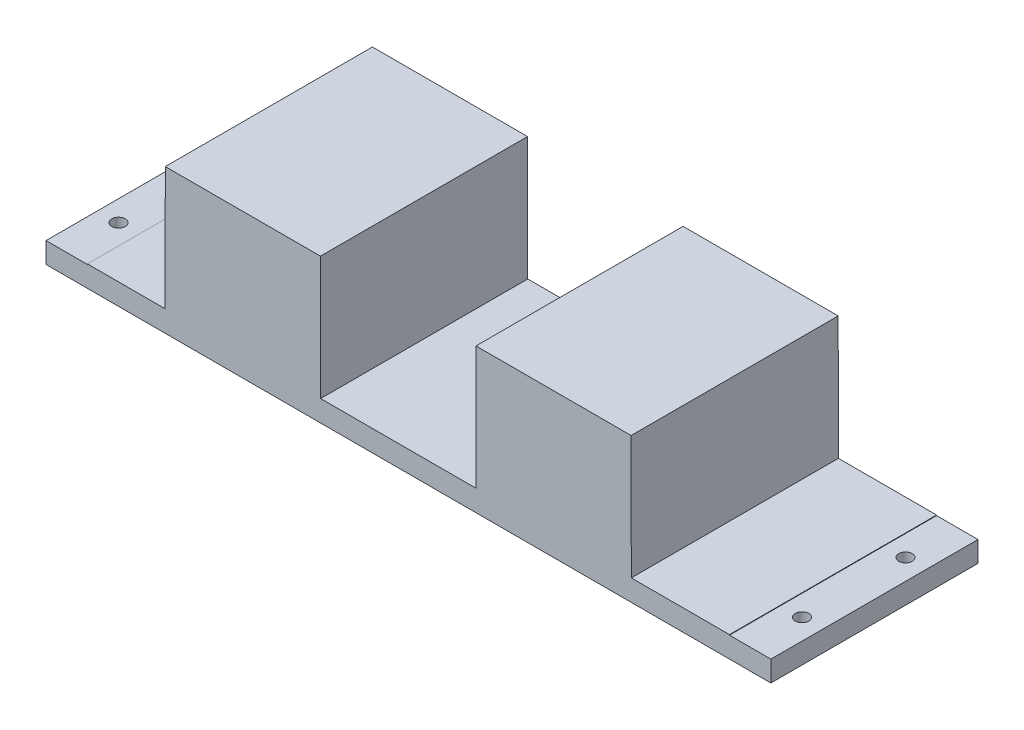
ISO-10303-21;
HEADER;
FILE_DESCRIPTION(('STEP AP214'),'2;1');
FILE_NAME('part.step','',(''),(''),'','','');
FILE_SCHEMA(('AUTOMOTIVE_DESIGN { 1 0 10303 214 1 1 1 1 }'));
ENDSEC;
DATA;
#1=APPLICATION_CONTEXT('core data for automotive mechanical design processes');
#2=APPLICATION_PROTOCOL_DEFINITION('international standard','automotive_design',2000,#1);
#3=PRODUCT_CONTEXT('',#1,'mechanical');
#4=PRODUCT('Part','Part','',(#3));
#5=PRODUCT_RELATED_PRODUCT_CATEGORY('part','',(#4));
#6=PRODUCT_DEFINITION_FORMATION('','',#4);
#7=PRODUCT_DEFINITION_CONTEXT('part definition',#1,'design');
#8=PRODUCT_DEFINITION('design','',#6,#7);
#9=PRODUCT_DEFINITION_SHAPE('','',#8);
#10=(LENGTH_UNIT() NAMED_UNIT(*) SI_UNIT(.MILLI.,.METRE.));
#11=(NAMED_UNIT(*) PLANE_ANGLE_UNIT() SI_UNIT($,.RADIAN.));
#12=(NAMED_UNIT(*) SI_UNIT($,.STERADIAN.) SOLID_ANGLE_UNIT());
#13=UNCERTAINTY_MEASURE_WITH_UNIT(LENGTH_MEASURE(1.E-05),#10,'distance_accuracy_value','');
#14=(GEOMETRIC_REPRESENTATION_CONTEXT(3) GLOBAL_UNCERTAINTY_ASSIGNED_CONTEXT((#13)) GLOBAL_UNIT_ASSIGNED_CONTEXT((#10,
#11,#12)) REPRESENTATION_CONTEXT('',''));
#15=CARTESIAN_POINT('',(0.,0.,0.));
#16=DIRECTION('',(0.,0.,1.));
#17=DIRECTION('',(1.,0.,0.));
#18=AXIS2_PLACEMENT_3D('',#15,#16,#17);
#19=CARTESIAN_POINT('',(0.,0.248118,100.));
#20=DIRECTION('',(1.,0.,0.));
#21=DIRECTION('',(0.,0.,-1.));
#22=AXIS2_PLACEMENT_3D('',#19,#20,#21);
#23=PLANE('',#22);
#24=DIRECTION('',(0.,-1.,0.));
#25=VECTOR('',#24,1.);
#26=CARTESIAN_POINT('',(0.,0.248118,0.));
#27=LINE('',#26,#25);
#28=CARTESIAN_POINT('',(0.,0.248118,0.));
#29=VERTEX_POINT('',#28);
#30=CARTESIAN_POINT('',(0.,0.,0.));
#31=VERTEX_POINT('',#30);
#32=EDGE_CURVE('E179',#29,#31,#27,.T.);
#33=ORIENTED_EDGE('',*,*,#32,.T.);
#34=DIRECTION('',(0.,0.,-1.));
#35=VECTOR('',#34,1.);
#36=CARTESIAN_POINT('',(0.,0.,100.));
#37=LINE('',#36,#35);
#38=CARTESIAN_POINT('',(0.,0.,100.));
#39=VERTEX_POINT('',#38);
#40=EDGE_CURVE('E11',#39,#31,#37,.T.);
#41=ORIENTED_EDGE('',*,*,#40,.F.);
#42=DIRECTION('',(0.,-1.,0.));
#43=VECTOR('',#42,1.);
#44=CARTESIAN_POINT('',(0.,0.248118,100.));
#45=LINE('',#44,#43);
#46=CARTESIAN_POINT('',(0.,0.248118,100.));
#47=VERTEX_POINT('',#46);
#48=EDGE_CURVE('E215',#47,#39,#45,.T.);
#49=ORIENTED_EDGE('',*,*,#48,.F.);
#50=DIRECTION('',(0.,0.,-1.));
#51=VECTOR('',#50,1.);
#52=CARTESIAN_POINT('',(0.,0.248118,100.));
#53=LINE('',#52,#51);
#54=EDGE_CURVE('E175',#47,#29,#53,.T.);
#55=ORIENTED_EDGE('',*,*,#54,.T.);
#56=EDGE_LOOP('',(#33,#41,#49,#55));
#57=FACE_BOUND('',#56,.T.);
#58=ADVANCED_FACE('F33',(#57),#23,.F.);
#59=CARTESIAN_POINT('',(0.,0.,100.));
#60=DIRECTION('',(0.,-1.,0.));
#61=DIRECTION('',(1.,0.,0.));
#62=AXIS2_PLACEMENT_3D('',#59,#60,#61);
#63=PLANE('',#62);
#64=CARTESIAN_POINT('',(-10.,0.,25.));
#65=DIRECTION('',(0.,-1.,0.));
#66=DIRECTION('',(1.,0.,0.));
#67=AXIS2_PLACEMENT_3D('',#64,#65,#66);
#68=CIRCLE('',#67,3.25);
#69=CARTESIAN_POINT('',(-6.75,0.,25.));
#70=VERTEX_POINT('',#69);
#71=EDGE_CURVE('E183',#70,#70,#68,.T.);
#72=ORIENTED_EDGE('',*,*,#71,.T.);
#73=EDGE_LOOP('',(#72));
#74=FACE_BOUND('',#73,.T.);
#75=CARTESIAN_POINT('',(-10.,0.,75.));
#76=DIRECTION('',(0.,-1.,0.));
#77=DIRECTION('',(1.,0.,0.));
#78=AXIS2_PLACEMENT_3D('',#75,#76,#77);
#79=CIRCLE('',#78,3.25);
#80=CARTESIAN_POINT('',(-6.75,0.,75.));
#81=VERTEX_POINT('',#80);
#82=EDGE_CURVE('E260',#81,#81,#79,.T.);
#83=ORIENTED_EDGE('',*,*,#82,.T.);
#84=EDGE_LOOP('',(#83));
#85=FACE_BOUND('',#84,.T.);
#86=DIRECTION('',(-1.,0.,0.));
#87=VECTOR('',#86,1.);
#88=CARTESIAN_POINT('',(0.,0.,0.));
#89=LINE('',#88,#87);
#90=CARTESIAN_POINT('',(-20.,0.,0.));
#91=VERTEX_POINT('',#90);
#92=EDGE_CURVE('E182',#31,#91,#89,.T.);
#93=ORIENTED_EDGE('',*,*,#92,.T.);
#94=DIRECTION('',(0.,0.,-1.));
#95=VECTOR('',#94,1.);
#96=CARTESIAN_POINT('',(-20.,0.,100.));
#97=LINE('',#96,#95);
#98=CARTESIAN_POINT('',(-20.,0.,100.));
#99=VERTEX_POINT('',#98);
#100=EDGE_CURVE('E42',#99,#91,#97,.T.);
#101=ORIENTED_EDGE('',*,*,#100,.F.);
#102=DIRECTION('',(-1.,0.,0.));
#103=VECTOR('',#102,1.);
#104=CARTESIAN_POINT('',(0.,0.,100.));
#105=LINE('',#104,#103);
#106=EDGE_CURVE('E116',#39,#99,#105,.T.);
#107=ORIENTED_EDGE('',*,*,#106,.F.);
#108=ORIENTED_EDGE('',*,*,#40,.T.);
#109=EDGE_LOOP('',(#93,#101,#107,#108));
#110=FACE_BOUND('',#109,.T.);
#111=ADVANCED_FACE('F311',(#74,#85,#110),#63,.F.);
#112=CARTESIAN_POINT('',(-20.,0.,100.));
#113=DIRECTION('',(1.,0.,0.));
#114=DIRECTION('',(0.,0.,-1.));
#115=AXIS2_PLACEMENT_3D('',#112,#113,#114);
#116=PLANE('',#115);
#117=DIRECTION('',(0.,-1.,0.));
#118=VECTOR('',#117,1.);
#119=CARTESIAN_POINT('',(-20.,0.,0.));
#120=LINE('',#119,#118);
#121=CARTESIAN_POINT('',(-20.,-10.,0.));
#122=VERTEX_POINT('',#121);
#123=EDGE_CURVE('E185',#91,#122,#120,.T.);
#124=ORIENTED_EDGE('',*,*,#123,.T.);
#125=DIRECTION('',(0.,0.,-1.));
#126=VECTOR('',#125,1.);
#127=CARTESIAN_POINT('',(-20.,-10.,100.));
#128=LINE('',#127,#126);
#129=CARTESIAN_POINT('',(-20.,-10.,100.));
#130=VERTEX_POINT('',#129);
#131=EDGE_CURVE('E246',#130,#122,#128,.T.);
#132=ORIENTED_EDGE('',*,*,#131,.F.);
#133=DIRECTION('',(0.,-1.,0.));
#134=VECTOR('',#133,1.);
#135=CARTESIAN_POINT('',(-20.,0.,100.));
#136=LINE('',#135,#134);
#137=EDGE_CURVE('E275',#99,#130,#136,.T.);
#138=ORIENTED_EDGE('',*,*,#137,.F.);
#139=ORIENTED_EDGE('',*,*,#100,.T.);
#140=EDGE_LOOP('',(#124,#132,#138,#139));
#141=FACE_BOUND('',#140,.T.);
#142=ADVANCED_FACE('F314',(#141),#116,.F.);
#143=CARTESIAN_POINT('',(-20.,-10.,100.));
#144=DIRECTION('',(0.,1.,0.));
#145=DIRECTION('',(0.,0.,1.));
#146=AXIS2_PLACEMENT_3D('',#143,#144,#145);
#147=PLANE('',#146);
#148=CARTESIAN_POINT('',(-10.,-10.,25.));
#149=DIRECTION('',(0.,1.,0.));
#150=DIRECTION('',(0.,0.,1.));
#151=AXIS2_PLACEMENT_3D('',#148,#149,#150);
#152=CIRCLE('',#151,3.25);
#153=CARTESIAN_POINT('',(-10.,-10.,28.25));
#154=VERTEX_POINT('',#153);
#155=EDGE_CURVE('E36',#154,#154,#152,.T.);
#156=ORIENTED_EDGE('',*,*,#155,.T.);
#157=EDGE_LOOP('',(#156));
#158=FACE_BOUND('',#157,.T.);
#159=CARTESIAN_POINT('',(320.,-10.,25.));
#160=DIRECTION('',(0.,1.,0.));
#161=DIRECTION('',(0.,0.,1.));
#162=AXIS2_PLACEMENT_3D('',#159,#160,#161);
#163=CIRCLE('',#162,3.25000000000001);
#164=CARTESIAN_POINT('',(320.,-10.,28.25));
#165=VERTEX_POINT('',#164);
#166=EDGE_CURVE('E257',#165,#165,#163,.T.);
#167=ORIENTED_EDGE('',*,*,#166,.T.);
#168=EDGE_LOOP('',(#167));
#169=FACE_BOUND('',#168,.T.);
#170=CARTESIAN_POINT('',(320.,-10.,75.));
#171=DIRECTION('',(0.,1.,0.));
#172=DIRECTION('',(0.,0.,1.));
#173=AXIS2_PLACEMENT_3D('',#170,#171,#172);
#174=CIRCLE('',#173,3.25000000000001);
#175=CARTESIAN_POINT('',(320.,-10.,78.25));
#176=VERTEX_POINT('',#175);
#177=EDGE_CURVE('E254',#176,#176,#174,.T.);
#178=ORIENTED_EDGE('',*,*,#177,.T.);
#179=EDGE_LOOP('',(#178));
#180=FACE_BOUND('',#179,.T.);
#181=CARTESIAN_POINT('',(-10.,-10.,75.));
#182=DIRECTION('',(0.,1.,0.));
#183=DIRECTION('',(0.,0.,1.));
#184=AXIS2_PLACEMENT_3D('',#181,#182,#183);
#185=CIRCLE('',#184,3.25);
#186=CARTESIAN_POINT('',(-10.,-10.,78.25));
#187=VERTEX_POINT('',#186);
#188=EDGE_CURVE('E258',#187,#187,#185,.T.);
#189=ORIENTED_EDGE('',*,*,#188,.T.);
#190=EDGE_LOOP('',(#189));
#191=FACE_BOUND('',#190,.T.);
#192=DIRECTION('',(1.,0.,0.));
#193=VECTOR('',#192,1.);
#194=CARTESIAN_POINT('',(-20.,-10.,0.));
#195=LINE('',#194,#193);
#196=CARTESIAN_POINT('',(330.,-10.,0.));
#197=VERTEX_POINT('',#196);
#198=EDGE_CURVE('E187',#122,#197,#195,.T.);
#199=ORIENTED_EDGE('',*,*,#198,.T.);
#200=DIRECTION('',(0.,0.,-1.));
#201=VECTOR('',#200,1.);
#202=CARTESIAN_POINT('',(330.,-10.,100.));
#203=LINE('',#202,#201);
#204=CARTESIAN_POINT('',(330.,-10.,100.));
#205=VERTEX_POINT('',#204);
#206=EDGE_CURVE('E243',#205,#197,#203,.T.);
#207=ORIENTED_EDGE('',*,*,#206,.F.);
#208=DIRECTION('',(1.,0.,0.));
#209=VECTOR('',#208,1.);
#210=CARTESIAN_POINT('',(-20.,-10.,100.));
#211=LINE('',#210,#209);
#212=EDGE_CURVE('E277',#130,#205,#211,.T.);
#213=ORIENTED_EDGE('',*,*,#212,.F.);
#214=ORIENTED_EDGE('',*,*,#131,.T.);
#215=EDGE_LOOP('',(#199,#207,#213,#214));
#216=FACE_BOUND('',#215,.T.);
#217=ADVANCED_FACE('F319',(#158,#169,#180,#191,#216),#147,.F.);
#218=CARTESIAN_POINT('',(330.,-10.,100.));
#219=DIRECTION('',(-1.,0.,0.));
#220=DIRECTION('',(0.,0.,1.));
#221=AXIS2_PLACEMENT_3D('',#218,#219,#220);
#222=PLANE('',#221);
#223=DIRECTION('',(0.,1.,0.));
#224=VECTOR('',#223,1.);
#225=CARTESIAN_POINT('',(330.,-10.,0.));
#226=LINE('',#225,#224);
#227=CARTESIAN_POINT('',(330.,-1.04603825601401E-12,0.));
#228=VERTEX_POINT('',#227);
#229=EDGE_CURVE('E189',#197,#228,#226,.T.);
#230=ORIENTED_EDGE('',*,*,#229,.T.);
#231=DIRECTION('',(0.,0.,-1.));
#232=VECTOR('',#231,1.);
#233=CARTESIAN_POINT('',(330.,-1.04603825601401E-12,100.));
#234=LINE('',#233,#232);
#235=CARTESIAN_POINT('',(330.,-1.04603825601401E-12,100.));
#236=VERTEX_POINT('',#235);
#237=EDGE_CURVE('E240',#236,#228,#234,.T.);
#238=ORIENTED_EDGE('',*,*,#237,.F.);
#239=DIRECTION('',(0.,1.,0.));
#240=VECTOR('',#239,1.);
#241=CARTESIAN_POINT('',(330.,-10.,100.));
#242=LINE('',#241,#240);
#243=EDGE_CURVE('E279',#205,#236,#242,.T.);
#244=ORIENTED_EDGE('',*,*,#243,.F.);
#245=ORIENTED_EDGE('',*,*,#206,.T.);
#246=EDGE_LOOP('',(#230,#238,#244,#245));
#247=FACE_BOUND('',#246,.T.);
#248=ADVANCED_FACE('F325',(#247),#222,.F.);
#249=CARTESIAN_POINT('',(330.,-1.04603825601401E-12,100.));
#250=DIRECTION('',(0.,-1.,0.));
#251=DIRECTION('',(1.,0.,0.));
#252=AXIS2_PLACEMENT_3D('',#249,#250,#251);
#253=PLANE('',#252);
#254=CARTESIAN_POINT('',(320.,-5.27355936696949E-13,25.));
#255=DIRECTION('',(0.,-1.,0.));
#256=DIRECTION('',(1.,0.,0.));
#257=AXIS2_PLACEMENT_3D('',#254,#255,#256);
#258=CIRCLE('',#257,3.25000000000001);
#259=CARTESIAN_POINT('',(323.25,-6.97337229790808E-13,25.));
#260=VERTEX_POINT('',#259);
#261=EDGE_CURVE('E255',#260,#260,#258,.T.);
#262=ORIENTED_EDGE('',*,*,#261,.T.);
#263=EDGE_LOOP('',(#262));
#264=FACE_BOUND('',#263,.T.);
#265=CARTESIAN_POINT('',(320.,-5.27355936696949E-13,75.));
#266=DIRECTION('',(0.,-1.,0.));
#267=DIRECTION('',(1.,0.,0.));
#268=AXIS2_PLACEMENT_3D('',#265,#266,#267);
#269=CIRCLE('',#268,3.25000000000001);
#270=CARTESIAN_POINT('',(323.25,-6.97337229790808E-13,75.));
#271=VERTEX_POINT('',#270);
#272=EDGE_CURVE('E251',#271,#271,#269,.T.);
#273=ORIENTED_EDGE('',*,*,#272,.T.);
#274=EDGE_LOOP('',(#273));
#275=FACE_BOUND('',#274,.T.);
#276=DIRECTION('',(-1.,0.,0.));
#277=VECTOR('',#276,1.);
#278=CARTESIAN_POINT('',(330.,-1.04603825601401E-12,0.));
#279=LINE('',#278,#277);
#280=CARTESIAN_POINT('',(310.000009,0.,0.));
#281=VERTEX_POINT('',#280);
#282=EDGE_CURVE('E191',#228,#281,#279,.T.);
#283=ORIENTED_EDGE('',*,*,#282,.T.);
#284=DIRECTION('',(0.,0.,-1.));
#285=VECTOR('',#284,1.);
#286=CARTESIAN_POINT('',(310.000009,0.,100.));
#287=LINE('',#286,#285);
#288=CARTESIAN_POINT('',(310.000009,0.,100.));
#289=VERTEX_POINT('',#288);
#290=EDGE_CURVE('E237',#289,#281,#287,.T.);
#291=ORIENTED_EDGE('',*,*,#290,.F.);
#292=DIRECTION('',(-1.,0.,0.));
#293=VECTOR('',#292,1.);
#294=CARTESIAN_POINT('',(330.,-1.04603825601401E-12,100.));
#295=LINE('',#294,#293);
#296=EDGE_CURVE('E281',#236,#289,#295,.T.);
#297=ORIENTED_EDGE('',*,*,#296,.F.);
#298=ORIENTED_EDGE('',*,*,#237,.T.);
#299=EDGE_LOOP('',(#283,#291,#297,#298));
#300=FACE_BOUND('',#299,.T.);
#301=ADVANCED_FACE('F329',(#264,#275,#300),#253,.F.);
#302=CARTESIAN_POINT('',(310.000009,0.,100.));
#303=DIRECTION('',(-1.,0.,0.));
#304=DIRECTION('',(0.,0.,1.));
#305=AXIS2_PLACEMENT_3D('',#302,#303,#304);
#306=PLANE('',#305);
#307=DIRECTION('',(0.,1.,0.));
#308=VECTOR('',#307,1.);
#309=CARTESIAN_POINT('',(310.000009,0.,0.));
#310=LINE('',#309,#308);
#311=CARTESIAN_POINT('',(310.000009,0.248118,0.));
#312=VERTEX_POINT('',#311);
#313=EDGE_CURVE('E193',#281,#312,#310,.T.);
#314=ORIENTED_EDGE('',*,*,#313,.T.);
#315=DIRECTION('',(0.,0.,-1.));
#316=VECTOR('',#315,1.);
#317=CARTESIAN_POINT('',(310.000009,0.248118,100.));
#318=LINE('',#317,#316);
#319=CARTESIAN_POINT('',(310.000009,0.248118,100.));
#320=VERTEX_POINT('',#319);
#321=EDGE_CURVE('E234',#320,#312,#318,.T.);
#322=ORIENTED_EDGE('',*,*,#321,.F.);
#323=DIRECTION('',(0.,1.,0.));
#324=VECTOR('',#323,1.);
#325=CARTESIAN_POINT('',(310.000009,0.,100.));
#326=LINE('',#325,#324);
#327=EDGE_CURVE('E283',#289,#320,#326,.T.);
#328=ORIENTED_EDGE('',*,*,#327,.F.);
#329=ORIENTED_EDGE('',*,*,#290,.T.);
#330=EDGE_LOOP('',(#314,#322,#328,#329));
#331=FACE_BOUND('',#330,.T.);
#332=ADVANCED_FACE('F334',(#331),#306,.F.);
#333=CARTESIAN_POINT('',(262.600032,0.248118,100.));
#334=DIRECTION('',(0.,-1.,0.));
#335=DIRECTION('',(0.,0.,-1.));
#336=AXIS2_PLACEMENT_3D('',#333,#334,#335);
#337=PLANE('',#336);
#338=DIRECTION('',(-1.,0.,0.));
#339=VECTOR('',#338,1.);
#340=CARTESIAN_POINT('',(262.600032,0.248118,0.));
#341=LINE('',#340,#339);
#342=CARTESIAN_POINT('',(262.600032,0.248118,0.));
#343=VERTEX_POINT('',#342);
#344=EDGE_CURVE('E196',#312,#343,#341,.T.);
#345=ORIENTED_EDGE('',*,*,#344,.T.);
#346=DIRECTION('',(0.,0.,-1.));
#347=VECTOR('',#346,1.);
#348=CARTESIAN_POINT('',(262.600032,0.248118,100.));
#349=LINE('',#348,#347);
#350=CARTESIAN_POINT('',(262.600032,0.248118,100.));
#351=VERTEX_POINT('',#350);
#352=EDGE_CURVE('E231',#351,#343,#349,.T.);
#353=ORIENTED_EDGE('',*,*,#352,.F.);
#354=DIRECTION('',(-1.,0.,0.));
#355=VECTOR('',#354,1.);
#356=CARTESIAN_POINT('',(309.899991,0.248118,100.));
#357=LINE('',#356,#355);
#358=EDGE_CURVE('E285',#320,#351,#357,.T.);
#359=ORIENTED_EDGE('',*,*,#358,.F.);
#360=ORIENTED_EDGE('',*,*,#321,.T.);
#361=EDGE_LOOP('',(#345,#353,#359,#360));
#362=FACE_BOUND('',#361,.T.);
#363=ADVANCED_FACE('F340',(#362),#337,.F.);
#364=CARTESIAN_POINT('',(262.500014,59.749809,100.));
#365=DIRECTION('',(-0.999998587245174,-0.00168092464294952,0.));
#366=DIRECTION('',(0.00168092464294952,-0.999998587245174,0.));
#367=AXIS2_PLACEMENT_3D('',#364,#365,#366);
#368=PLANE('',#367);
#369=DIRECTION('',(-0.00168092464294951,0.999998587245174,0.));
#370=VECTOR('',#369,1.);
#371=CARTESIAN_POINT('',(262.500014,59.749809,0.));
#372=LINE('',#371,#370);
#373=CARTESIAN_POINT('',(262.500014,59.749809,0.));
#374=VERTEX_POINT('',#373);
#375=EDGE_CURVE('E198',#343,#374,#372,.T.);
#376=ORIENTED_EDGE('',*,*,#375,.T.);
#377=DIRECTION('',(0.,0.,-1.));
#378=VECTOR('',#377,1.);
#379=CARTESIAN_POINT('',(262.500014,59.749809,100.));
#380=LINE('',#379,#378);
#381=CARTESIAN_POINT('',(262.500014,59.749809,100.));
#382=VERTEX_POINT('',#381);
#383=EDGE_CURVE('E228',#382,#374,#380,.T.);
#384=ORIENTED_EDGE('',*,*,#383,.F.);
#385=DIRECTION('',(-0.00168092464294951,0.999998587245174,0.));
#386=VECTOR('',#385,1.);
#387=CARTESIAN_POINT('',(262.500014,59.749809,100.));
#388=LINE('',#387,#386);
#389=EDGE_CURVE('E287',#351,#382,#388,.T.);
#390=ORIENTED_EDGE('',*,*,#389,.F.);
#391=ORIENTED_EDGE('',*,*,#352,.T.);
#392=EDGE_LOOP('',(#376,#384,#390,#391));
#393=FACE_BOUND('',#392,.T.);
#394=ADVANCED_FACE('F343',(#393),#368,.F.);
#395=CARTESIAN_POINT('',(187.599996,59.749809,100.));
#396=DIRECTION('',(0.,-1.,0.));
#397=DIRECTION('',(0.,0.,-1.));
#398=AXIS2_PLACEMENT_3D('',#395,#396,#397);
#399=PLANE('',#398);
#400=DIRECTION('',(-1.,0.,0.));
#401=VECTOR('',#400,1.);
#402=CARTESIAN_POINT('',(187.599996,59.749809,0.));
#403=LINE('',#402,#401);
#404=CARTESIAN_POINT('',(187.599996,59.749809,0.));
#405=VERTEX_POINT('',#404);
#406=EDGE_CURVE('E201',#374,#405,#403,.T.);
#407=ORIENTED_EDGE('',*,*,#406,.T.);
#408=DIRECTION('',(0.,0.,-1.));
#409=VECTOR('',#408,1.);
#410=CARTESIAN_POINT('',(187.599996,59.749809,100.));
#411=LINE('',#410,#409);
#412=CARTESIAN_POINT('',(187.599996,59.749809,100.));
#413=VERTEX_POINT('',#412);
#414=EDGE_CURVE('E225',#413,#405,#411,.T.);
#415=ORIENTED_EDGE('',*,*,#414,.F.);
#416=DIRECTION('',(-1.,0.,0.));
#417=VECTOR('',#416,1.);
#418=CARTESIAN_POINT('',(262.399996,59.749809,100.));
#419=LINE('',#418,#417);
#420=EDGE_CURVE('E289',#382,#413,#419,.T.);
#421=ORIENTED_EDGE('',*,*,#420,.F.);
#422=ORIENTED_EDGE('',*,*,#383,.T.);
#423=EDGE_LOOP('',(#407,#415,#421,#422));
#424=FACE_BOUND('',#423,.T.);
#425=ADVANCED_FACE('F347',(#424),#399,.F.);
#426=CARTESIAN_POINT('',(187.500015,0.248118,100.));
#427=DIRECTION('',(0.999998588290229,-0.00168030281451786,0.));
#428=DIRECTION('',(0.00168030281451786,0.999998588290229,0.));
#429=AXIS2_PLACEMENT_3D('',#426,#427,#428);
#430=PLANE('',#429);
#431=DIRECTION('',(-0.00168030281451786,-0.999998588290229,0.));
#432=VECTOR('',#431,1.);
#433=CARTESIAN_POINT('',(187.500015,0.248118,0.));
#434=LINE('',#433,#432);
#435=CARTESIAN_POINT('',(187.500015,0.248118,0.));
#436=VERTEX_POINT('',#435);
#437=EDGE_CURVE('E203',#405,#436,#434,.T.);
#438=ORIENTED_EDGE('',*,*,#437,.T.);
#439=DIRECTION('',(0.,0.,-1.));
#440=VECTOR('',#439,1.);
#441=CARTESIAN_POINT('',(187.500015,0.248118,100.));
#442=LINE('',#441,#440);
#443=CARTESIAN_POINT('',(187.500015,0.248118,100.));
#444=VERTEX_POINT('',#443);
#445=EDGE_CURVE('E222',#444,#436,#442,.T.);
#446=ORIENTED_EDGE('',*,*,#445,.F.);
#447=DIRECTION('',(-0.00168030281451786,-0.999998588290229,0.));
#448=VECTOR('',#447,1.);
#449=CARTESIAN_POINT('',(187.500015,0.248118,100.));
#450=LINE('',#449,#448);
#451=EDGE_CURVE('E291',#413,#444,#450,.T.);
#452=ORIENTED_EDGE('',*,*,#451,.F.);
#453=ORIENTED_EDGE('',*,*,#414,.T.);
#454=EDGE_LOOP('',(#438,#446,#452,#453));
#455=FACE_BOUND('',#454,.T.);
#456=ADVANCED_FACE('F349',(#455),#430,.F.);
#457=CARTESIAN_POINT('',(112.599997,0.248118,100.));
#458=DIRECTION('',(0.,-1.,0.));
#459=DIRECTION('',(0.,0.,-1.));
#460=AXIS2_PLACEMENT_3D('',#457,#458,#459);
#461=PLANE('',#460);
#462=DIRECTION('',(-1.,0.,0.));
#463=VECTOR('',#462,1.);
#464=CARTESIAN_POINT('',(112.599997,0.248118,0.));
#465=LINE('',#464,#463);
#466=CARTESIAN_POINT('',(112.599997,0.248118,0.));
#467=VERTEX_POINT('',#466);
#468=EDGE_CURVE('E206',#436,#467,#465,.T.);
#469=ORIENTED_EDGE('',*,*,#468,.T.);
#470=DIRECTION('',(0.,0.,-1.));
#471=VECTOR('',#470,1.);
#472=CARTESIAN_POINT('',(112.599997,0.248118,100.));
#473=LINE('',#472,#471);
#474=CARTESIAN_POINT('',(112.599997,0.248118,100.));
#475=VERTEX_POINT('',#474);
#476=EDGE_CURVE('E219',#475,#467,#473,.T.);
#477=ORIENTED_EDGE('',*,*,#476,.F.);
#478=DIRECTION('',(-1.,0.,0.));
#479=VECTOR('',#478,1.);
#480=CARTESIAN_POINT('',(187.399997,0.248118,100.));
#481=LINE('',#480,#479);
#482=EDGE_CURVE('E293',#444,#475,#481,.T.);
#483=ORIENTED_EDGE('',*,*,#482,.F.);
#484=ORIENTED_EDGE('',*,*,#445,.T.);
#485=EDGE_LOOP('',(#469,#477,#483,#484));
#486=FACE_BOUND('',#485,.T.);
#487=ADVANCED_FACE('F299',(#486),#461,.F.);
#488=CARTESIAN_POINT('',(112.500017,59.749809,100.));
#489=DIRECTION('',(-0.999998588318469,-0.00168028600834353,0.));
#490=DIRECTION('',(0.00168028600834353,-0.999998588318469,0.));
#491=AXIS2_PLACEMENT_3D('',#488,#489,#490);
#492=PLANE('',#491);
#493=DIRECTION('',(-0.00168028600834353,0.999998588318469,0.));
#494=VECTOR('',#493,1.);
#495=CARTESIAN_POINT('',(112.500017,59.749809,0.));
#496=LINE('',#495,#494);
#497=CARTESIAN_POINT('',(112.500017,59.749809,0.));
#498=VERTEX_POINT('',#497);
#499=EDGE_CURVE('E208',#467,#498,#496,.T.);
#500=ORIENTED_EDGE('',*,*,#499,.T.);
#501=DIRECTION('',(0.,0.,-1.));
#502=VECTOR('',#501,1.);
#503=CARTESIAN_POINT('',(112.500017,59.749809,100.));
#504=LINE('',#503,#502);
#505=CARTESIAN_POINT('',(112.500017,59.749809,100.));
#506=VERTEX_POINT('',#505);
#507=EDGE_CURVE('E170',#506,#498,#504,.T.);
#508=ORIENTED_EDGE('',*,*,#507,.F.);
#509=DIRECTION('',(-0.00168028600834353,0.999998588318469,0.));
#510=VECTOR('',#509,1.);
#511=CARTESIAN_POINT('',(112.500017,59.749809,100.));
#512=LINE('',#511,#510);
#513=EDGE_CURVE('E160',#475,#506,#512,.T.);
#514=ORIENTED_EDGE('',*,*,#513,.F.);
#515=ORIENTED_EDGE('',*,*,#476,.T.);
#516=EDGE_LOOP('',(#500,#508,#514,#515));
#517=FACE_BOUND('',#516,.T.);
#518=ADVANCED_FACE('F302',(#517),#492,.F.);
#519=CARTESIAN_POINT('',(37.599999,59.749809,100.));
#520=DIRECTION('',(0.,-1.,0.));
#521=DIRECTION('',(0.,0.,-1.));
#522=AXIS2_PLACEMENT_3D('',#519,#520,#521);
#523=PLANE('',#522);
#524=DIRECTION('',(-1.,0.,0.));
#525=VECTOR('',#524,1.);
#526=CARTESIAN_POINT('',(37.599999,59.749809,0.));
#527=LINE('',#526,#525);
#528=CARTESIAN_POINT('',(37.599999,59.749809,0.));
#529=VERTEX_POINT('',#528);
#530=EDGE_CURVE('E168',#498,#529,#527,.T.);
#531=ORIENTED_EDGE('',*,*,#530,.T.);
#532=DIRECTION('',(0.,0.,-1.));
#533=VECTOR('',#532,1.);
#534=CARTESIAN_POINT('',(37.599999,59.749809,100.));
#535=LINE('',#534,#533);
#536=CARTESIAN_POINT('',(37.599999,59.749809,100.));
#537=VERTEX_POINT('',#536);
#538=EDGE_CURVE('E166',#537,#529,#535,.T.);
#539=ORIENTED_EDGE('',*,*,#538,.F.);
#540=DIRECTION('',(-1.,0.,0.));
#541=VECTOR('',#540,1.);
#542=CARTESIAN_POINT('',(112.399998,59.749809,100.));
#543=LINE('',#542,#541);
#544=EDGE_CURVE('E153',#506,#537,#543,.T.);
#545=ORIENTED_EDGE('',*,*,#544,.F.);
#546=ORIENTED_EDGE('',*,*,#507,.T.);
#547=EDGE_LOOP('',(#531,#539,#545,#546));
#548=FACE_BOUND('',#547,.T.);
#549=ADVANCED_FACE('F167',(#548),#523,.F.);
#550=CARTESIAN_POINT('',(37.500018,0.248118,100.));
#551=DIRECTION('',(0.999998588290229,-0.0016803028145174,0.));
#552=DIRECTION('',(0.0016803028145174,0.999998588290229,0.));
#553=AXIS2_PLACEMENT_3D('',#550,#551,#552);
#554=PLANE('',#553);
#555=DIRECTION('',(-0.0016803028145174,-0.999998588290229,0.));
#556=VECTOR('',#555,1.);
#557=CARTESIAN_POINT('',(37.500018,0.248118,0.));
#558=LINE('',#557,#556);
#559=CARTESIAN_POINT('',(37.500018,0.248118,0.));
#560=VERTEX_POINT('',#559);
#561=EDGE_CURVE('E212',#529,#560,#558,.T.);
#562=ORIENTED_EDGE('',*,*,#561,.T.);
#563=DIRECTION('',(0.,0.,-1.));
#564=VECTOR('',#563,1.);
#565=CARTESIAN_POINT('',(37.500018,0.248118,100.));
#566=LINE('',#565,#564);
#567=CARTESIAN_POINT('',(37.500018,0.248118,100.));
#568=VERTEX_POINT('',#567);
#569=EDGE_CURVE('E171',#568,#560,#566,.T.);
#570=ORIENTED_EDGE('',*,*,#569,.F.);
#571=DIRECTION('',(-0.0016803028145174,-0.999998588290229,0.));
#572=VECTOR('',#571,1.);
#573=CARTESIAN_POINT('',(37.500018,0.248118,100.));
#574=LINE('',#573,#572);
#575=EDGE_CURVE('E157',#537,#568,#574,.T.);
#576=ORIENTED_EDGE('',*,*,#575,.F.);
#577=ORIENTED_EDGE('',*,*,#538,.T.);
#578=EDGE_LOOP('',(#562,#570,#576,#577));
#579=FACE_BOUND('',#578,.T.);
#580=ADVANCED_FACE('F173',(#579),#554,.F.);
#581=CARTESIAN_POINT('',(0.,0.248118,100.));
#582=DIRECTION('',(0.,-1.,0.));
#583=DIRECTION('',(0.,0.,-1.));
#584=AXIS2_PLACEMENT_3D('',#581,#582,#583);
#585=PLANE('',#584);
#586=DIRECTION('',(-1.,0.,0.));
#587=VECTOR('',#586,1.);
#588=CARTESIAN_POINT('',(0.,0.248118,0.));
#589=LINE('',#588,#587);
#590=EDGE_CURVE('E104',#560,#29,#589,.T.);
#591=ORIENTED_EDGE('',*,*,#590,.T.);
#592=ORIENTED_EDGE('',*,*,#54,.F.);
#593=DIRECTION('',(-1.,0.,0.));
#594=VECTOR('',#593,1.);
#595=CARTESIAN_POINT('',(37.4,0.248118,100.));
#596=LINE('',#595,#594);
#597=EDGE_CURVE('E51',#568,#47,#596,.T.);
#598=ORIENTED_EDGE('',*,*,#597,.F.);
#599=ORIENTED_EDGE('',*,*,#569,.T.);
#600=EDGE_LOOP('',(#591,#592,#598,#599));
#601=FACE_BOUND('',#600,.T.);
#602=ADVANCED_FACE('F305',(#601),#585,.F.);
#603=CARTESIAN_POINT('',(0.,0.,100.));
#604=DIRECTION('',(0.,0.,-1.));
#605=DIRECTION('',(-1.,0.,0.));
#606=AXIS2_PLACEMENT_3D('',#603,#604,#605);
#607=PLANE('',#606);
#608=ORIENTED_EDGE('',*,*,#48,.T.);
#609=ORIENTED_EDGE('',*,*,#106,.T.);
#610=ORIENTED_EDGE('',*,*,#137,.T.);
#611=ORIENTED_EDGE('',*,*,#212,.T.);
#612=ORIENTED_EDGE('',*,*,#243,.T.);
#613=ORIENTED_EDGE('',*,*,#296,.T.);
#614=ORIENTED_EDGE('',*,*,#327,.T.);
#615=ORIENTED_EDGE('',*,*,#358,.T.);
#616=ORIENTED_EDGE('',*,*,#389,.T.);
#617=ORIENTED_EDGE('',*,*,#420,.T.);
#618=ORIENTED_EDGE('',*,*,#451,.T.);
#619=ORIENTED_EDGE('',*,*,#482,.T.);
#620=ORIENTED_EDGE('',*,*,#513,.T.);
#621=ORIENTED_EDGE('',*,*,#544,.T.);
#622=ORIENTED_EDGE('',*,*,#575,.T.);
#623=ORIENTED_EDGE('',*,*,#597,.T.);
#624=EDGE_LOOP('',(#608,#609,#610,#611,#612,#613,#614,#615,#616,#617,#618,#619,#620,#621,#622,#623));
#625=FACE_BOUND('',#624,.T.);
#626=ADVANCED_FACE('F155',(#625),#607,.F.);
#627=CARTESIAN_POINT('',(0.,0.,0.));
#628=DIRECTION('',(0.,0.,-1.));
#629=DIRECTION('',(-1.,0.,0.));
#630=AXIS2_PLACEMENT_3D('',#627,#628,#629);
#631=PLANE('',#630);
#632=ORIENTED_EDGE('',*,*,#32,.F.);
#633=ORIENTED_EDGE('',*,*,#590,.F.);
#634=ORIENTED_EDGE('',*,*,#561,.F.);
#635=ORIENTED_EDGE('',*,*,#530,.F.);
#636=ORIENTED_EDGE('',*,*,#499,.F.);
#637=ORIENTED_EDGE('',*,*,#468,.F.);
#638=ORIENTED_EDGE('',*,*,#437,.F.);
#639=ORIENTED_EDGE('',*,*,#406,.F.);
#640=ORIENTED_EDGE('',*,*,#375,.F.);
#641=ORIENTED_EDGE('',*,*,#344,.F.);
#642=ORIENTED_EDGE('',*,*,#313,.F.);
#643=ORIENTED_EDGE('',*,*,#282,.F.);
#644=ORIENTED_EDGE('',*,*,#229,.F.);
#645=ORIENTED_EDGE('',*,*,#198,.F.);
#646=ORIENTED_EDGE('',*,*,#123,.F.);
#647=ORIENTED_EDGE('',*,*,#92,.F.);
#648=EDGE_LOOP('',(#632,#633,#634,#635,#636,#637,#638,#639,#640,#641,#642,#643,#644,#645,#646,#647));
#649=FACE_BOUND('',#648,.T.);
#650=ADVANCED_FACE('F303',(#649),#631,.T.);
#651=CARTESIAN_POINT('',(320.,59.749809,75.));
#652=DIRECTION('',(0.,-1.,0.));
#653=DIRECTION('',(0.,0.,-1.));
#654=AXIS2_PLACEMENT_3D('',#651,#652,#653);
#655=CYLINDRICAL_SURFACE('',#654,3.25000000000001);
#656=ORIENTED_EDGE('',*,*,#272,.F.);
#657=EDGE_LOOP('',(#656));
#658=FACE_BOUND('',#657,.T.);
#659=ORIENTED_EDGE('',*,*,#177,.F.);
#660=EDGE_LOOP('',(#659));
#661=FACE_BOUND('',#660,.T.);
#662=ADVANCED_FACE('F455',(#658,#661),#655,.F.);
#663=CARTESIAN_POINT('',(320.,59.749809,25.));
#664=DIRECTION('',(0.,-1.,0.));
#665=DIRECTION('',(0.,0.,-1.));
#666=AXIS2_PLACEMENT_3D('',#663,#664,#665);
#667=CYLINDRICAL_SURFACE('',#666,3.25000000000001);
#668=ORIENTED_EDGE('',*,*,#261,.F.);
#669=EDGE_LOOP('',(#668));
#670=FACE_BOUND('',#669,.T.);
#671=ORIENTED_EDGE('',*,*,#166,.F.);
#672=EDGE_LOOP('',(#671));
#673=FACE_BOUND('',#672,.T.);
#674=ADVANCED_FACE('F485',(#670,#673),#667,.F.);
#675=CARTESIAN_POINT('',(-10.,59.749809,75.));
#676=DIRECTION('',(0.,-1.,0.));
#677=DIRECTION('',(0.,0.,-1.));
#678=AXIS2_PLACEMENT_3D('',#675,#676,#677);
#679=CYLINDRICAL_SURFACE('',#678,3.25);
#680=ORIENTED_EDGE('',*,*,#188,.F.);
#681=EDGE_LOOP('',(#680));
#682=FACE_BOUND('',#681,.T.);
#683=ORIENTED_EDGE('',*,*,#82,.F.);
#684=EDGE_LOOP('',(#683));
#685=FACE_BOUND('',#684,.T.);
#686=ADVANCED_FACE('F495',(#682,#685),#679,.F.);
#687=CARTESIAN_POINT('',(-10.,59.749809,25.));
#688=DIRECTION('',(0.,-1.,0.));
#689=DIRECTION('',(0.,0.,-1.));
#690=AXIS2_PLACEMENT_3D('',#687,#688,#689);
#691=CYLINDRICAL_SURFACE('',#690,3.25);
#692=ORIENTED_EDGE('',*,*,#155,.F.);
#693=EDGE_LOOP('',(#692));
#694=FACE_BOUND('',#693,.T.);
#695=ORIENTED_EDGE('',*,*,#71,.F.);
#696=EDGE_LOOP('',(#695));
#697=FACE_BOUND('',#696,.T.);
#698=ADVANCED_FACE('F505',(#694,#697),#691,.F.);
#699=CLOSED_SHELL('',(#58,#111,#142,#217,#248,#301,#332,#363,#394,#425,#456,#487,#518,#549,#580,
#602,#626,#650,#662,#674,#686,#698));
#700=MANIFOLD_SOLID_BREP('B2',#699);
#701=ADVANCED_BREP_SHAPE_REPRESENTATION('',(#18,#700),#14);
#702=SHAPE_DEFINITION_REPRESENTATION(#9,#701);
ENDSEC;
END-ISO-10303-21;
